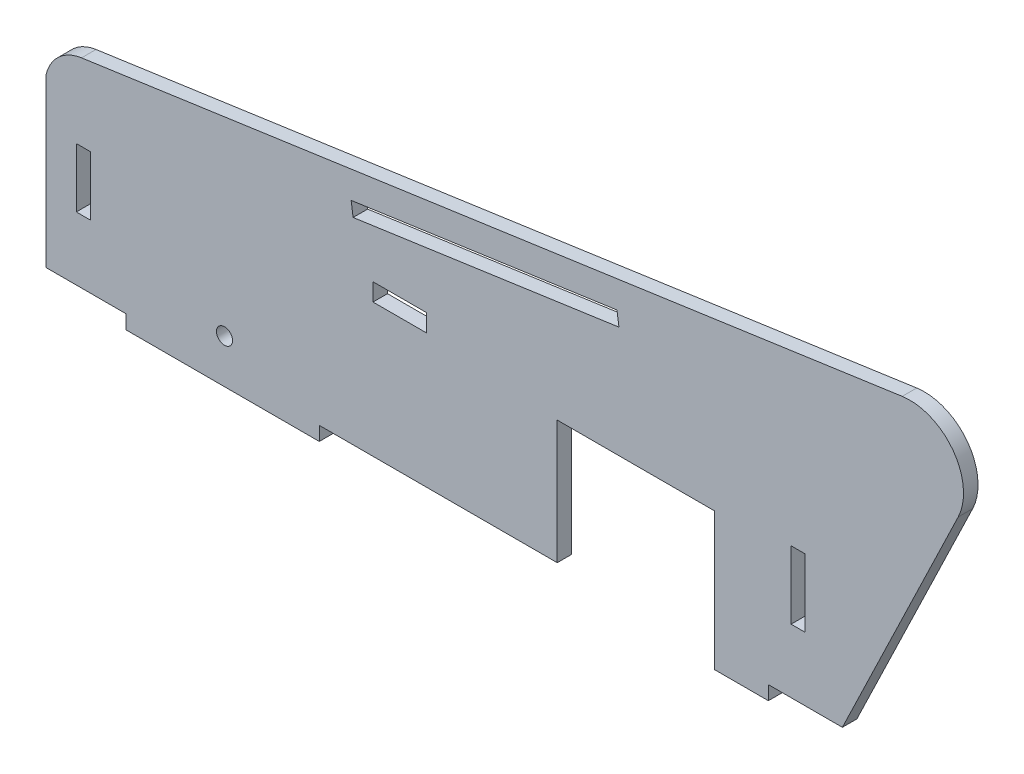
from build123d import *

# Parameters (mm, degrees)
CROQUIS1_R              = 1.5
CROQUIS1_W              = 10
CROQUIS1_H              = 3.270129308
CROQUIS1_W_2            = 2.6
CROQUIS1_H_2            = 11.038214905
CROQUIS1_H_3            = 12.640584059
SALIENTE_EXTRUIR1_DEPTH = 2.7


with BuildPart() as part:
    # Croquis1 → Saliente-Extruir1 (new body)
    with BuildSketch(Plane.XY):
        with BuildLine():
            Line((-35.281193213, -24.882755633), (-20.39370071, -24.882755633))
            Line((-20.39370071, -24.882755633), (-20.39370071, -27.482755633))
            Line((-20.39370071, -27.482755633), (15.60629929, -27.482755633))
            Line((15.60629929, -27.482755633), (15.60629929, -24.882755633))
            Line((15.60629929, -24.882755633), (20.21629929, -24.882755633))
            Line((20.21629929, -24.882755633), (59.91129929, -24.882755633))
            Line((59.91129929, -24.882755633), (59.91129929, -6.882755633))
            Line((59.91129929, -6.882755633), (59.91129929, -1.882755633))
            Line((59.91129929, -1.882755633), (89.21629929, -1.882755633))
            Line((89.21629929, -1.882755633), (89.21629929, -6.882755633))
            Line((89.21629929, -6.882755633), (89.21629929, -27.482755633))
            Line((89.21629929, -27.482755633), (99.222751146, -27.482755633))
            Line((99.222751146, -27.482755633), (99.222751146, -24.882755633))
            Line((99.222751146, -24.882755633), (113.001197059, -24.882755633))
            Line((113.001197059, -24.882755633), (134.567059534, 19.816149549))
            ThreePointArc((134.567059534, 19.816149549), (133.631635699, 30.065524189), (124.146911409, 34.061109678))
            Line((124.146911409, 34.061109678), (-28.669918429, 12.239596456))
            ThreePointArc((-28.669918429, 12.239596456), (-32.904854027, 10.242111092), (-35.281193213, 6.207555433))
            Line((-35.281193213, 6.207555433), (-35.281193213, -24.882755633))
        make_face()
        with Locations(Location((-2.042760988, -19.301130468, 0), (0, 0, 180))):
            Circle(CROQUIS1_R, mode=Mode.SUBTRACT)
        with Locations((30.60629929, 1.635064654)):
            Rectangle(CROQUIS1_W, CROQUIS1_H, mode=Mode.SUBTRACT)
        with Locations((-28.338667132, -7.579298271)):
            Rectangle(CROQUIS1_W_2, CROQUIS1_H_2, mode=Mode.SUBTRACT)
        Polygon((71.032695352, 21.425934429), (21.53479167, 14.357870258), (21.902331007, 11.783979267), (71.400234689, 18.852043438), align=None, mode=Mode.SUBTRACT)
        with Locations((104.753882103, -6.703088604)):
            Rectangle(CROQUIS1_W_2, CROQUIS1_H_3, mode=Mode.SUBTRACT)
    extrude(amount=SALIENTE_EXTRUIR1_DEPTH)


solid = part.part
